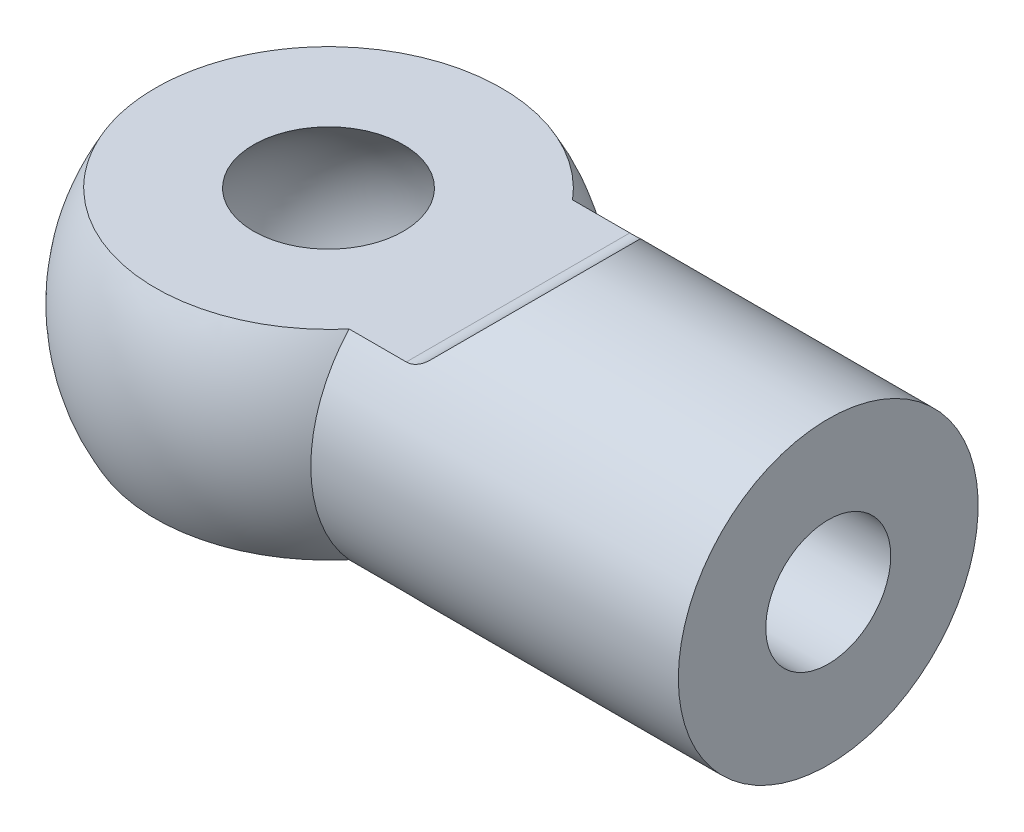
ISO-10303-21;
HEADER;
FILE_DESCRIPTION(('STEP AP214'),'2;1');
FILE_NAME('part.step','',(''),(''),'','','');
FILE_SCHEMA(('AUTOMOTIVE_DESIGN { 1 0 10303 214 1 1 1 1 }'));
ENDSEC;
DATA;
#1=APPLICATION_CONTEXT('core data for automotive mechanical design processes');
#2=APPLICATION_PROTOCOL_DEFINITION('international standard','automotive_design',2000,#1);
#3=PRODUCT_CONTEXT('',#1,'mechanical');
#4=PRODUCT('Part','Part','',(#3));
#5=PRODUCT_RELATED_PRODUCT_CATEGORY('part','',(#4));
#6=PRODUCT_DEFINITION_FORMATION('','',#4);
#7=PRODUCT_DEFINITION_CONTEXT('part definition',#1,'design');
#8=PRODUCT_DEFINITION('design','',#6,#7);
#9=PRODUCT_DEFINITION_SHAPE('','',#8);
#10=(LENGTH_UNIT() NAMED_UNIT(*) SI_UNIT(.MILLI.,.METRE.));
#11=(NAMED_UNIT(*) PLANE_ANGLE_UNIT() SI_UNIT($,.RADIAN.));
#12=(NAMED_UNIT(*) SI_UNIT($,.STERADIAN.) SOLID_ANGLE_UNIT());
#13=UNCERTAINTY_MEASURE_WITH_UNIT(LENGTH_MEASURE(1.E-05),#10,'distance_accuracy_value','');
#14=(GEOMETRIC_REPRESENTATION_CONTEXT(3) GLOBAL_UNCERTAINTY_ASSIGNED_CONTEXT((#13)) GLOBAL_UNIT_ASSIGNED_CONTEXT((#10,
#11,#12)) REPRESENTATION_CONTEXT('',''));
#15=CARTESIAN_POINT('',(0.,0.,0.));
#16=DIRECTION('',(0.,0.,1.));
#17=DIRECTION('',(1.,0.,0.));
#18=AXIS2_PLACEMENT_3D('',#15,#16,#17);
#19=CARTESIAN_POINT('',(0.,0.,0.));
#20=DIRECTION('',(-1.,0.,0.));
#21=DIRECTION('',(0.,0.,1.));
#22=AXIS2_PLACEMENT_3D('',#19,#20,#21);
#23=CYLINDRICAL_SURFACE('',#22,3.);
#24=CARTESIAN_POINT('',(10.,0.,0.));
#25=DIRECTION('',(-1.,0.,0.));
#26=DIRECTION('',(0.,0.,1.));
#27=AXIS2_PLACEMENT_3D('',#24,#25,#26);
#28=CIRCLE('',#27,3.);
#29=CARTESIAN_POINT('',(10.,0.,3.));
#30=VERTEX_POINT('',#29);
#31=EDGE_CURVE('E419',#30,#30,#28,.T.);
#32=ORIENTED_EDGE('',*,*,#31,.T.);
#33=EDGE_LOOP('',(#32));
#34=FACE_BOUND('',#33,.T.);
#35=DIRECTION('',(-1.,0.,0.));
#36=VECTOR('',#35,1.);
#37=CARTESIAN_POINT('',(0.,-2.,2.23606797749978));
#38=LINE('',#37,#36);
#39=CARTESIAN_POINT('',(2.6457513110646,-2.,2.23606797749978));
#40=VERTEX_POINT('',#39);
#41=CARTESIAN_POINT('',(3.79289321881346,-2.,2.23606797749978));
#42=VERTEX_POINT('',#41);
#43=EDGE_CURVE('E406',#40,#42,#38,.F.);
#44=ORIENTED_EDGE('',*,*,#43,.T.);
#45=CARTESIAN_POINT('',(3.79289321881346,-2.,2.23606797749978));
#46=CARTESIAN_POINT('',(3.81564348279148,-1.9999628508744,2.23609073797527));
#47=CARTESIAN_POINT('',(3.83835658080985,-2.00155029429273,2.23468148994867));
#48=CARTESIAN_POINT('',(3.88283202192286,-2.00765885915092,2.22920042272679));
#49=CARTESIAN_POINT('',(3.90460147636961,-2.01215122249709,2.22515470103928));
#50=CARTESIAN_POINT('',(3.94675574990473,-2.02375741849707,2.21460221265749));
#51=CARTESIAN_POINT('',(3.96714227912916,-2.03086794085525,2.20809855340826));
#52=CARTESIAN_POINT('',(4.00622199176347,-2.04729507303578,2.19287707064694));
#53=CARTESIAN_POINT('',(4.02490733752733,-2.05662124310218,2.1841496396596));
#54=CARTESIAN_POINT('',(4.06262231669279,-2.07835769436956,2.16348786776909));
#55=CARTESIAN_POINT('',(4.08135643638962,-2.09101453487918,2.15127938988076));
#56=CARTESIAN_POINT('',(4.11599095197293,-2.11778814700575,2.12493153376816));
#57=CARTESIAN_POINT('',(4.13190935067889,-2.13189465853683,2.11080552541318));
#58=CARTESIAN_POINT('',(4.14644660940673,-2.14644660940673,2.09589287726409));
#59=B_SPLINE_CURVE_WITH_KNOTS('',3,(#45,#46,#47,#48,#49,#50,#51,#52,#53,#54,#55,#56,#57,#58),
.UNSPECIFIED.,.F.,.F.,(4,2,2,2,2,2,4),(0.,0.0680932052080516,0.135522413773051,
0.202866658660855,0.270506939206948,0.347299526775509,0.423581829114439),.UNSPECIFIED.);
#60=CARTESIAN_POINT('',(4.14644660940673,-2.14644660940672,2.09589287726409));
#61=VERTEX_POINT('',#60);
#62=EDGE_CURVE('E11',#42,#61,#59,.T.);
#63=ORIENTED_EDGE('',*,*,#62,.T.);
#64=CARTESIAN_POINT('',(1.99999999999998,0.,0.));
#65=DIRECTION('',(0.707106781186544,0.707106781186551,0.));
#66=DIRECTION('',(-0.707106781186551,0.707106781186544,0.));
#67=AXIS2_PLACEMENT_3D('',#64,#65,#66);
#68=ELLIPSE('',#67,4.2426406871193,3.);
#69=CARTESIAN_POINT('',(4.14644660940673,-2.14644660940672,-2.09589287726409));
#70=VERTEX_POINT('',#69);
#71=EDGE_CURVE('E533',#61,#70,#68,.T.);
#72=ORIENTED_EDGE('',*,*,#71,.T.);
#73=CARTESIAN_POINT('',(4.14644660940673,-2.14644660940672,-2.09589287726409));
#74=CARTESIAN_POINT('',(4.13093845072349,-2.13091869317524,-2.11180744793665));
#75=CARTESIAN_POINT('',(4.1138494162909,-2.11589564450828,-2.12682631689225));
#76=CARTESIAN_POINT('',(4.07642523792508,-2.08749027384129,-2.15470922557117));
#77=CARTESIAN_POINT('',(4.05605806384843,-2.07412672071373,-2.16754912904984));
#78=CARTESIAN_POINT('',(4.01215742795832,-2.04993821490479,-2.19044220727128));
#79=CARTESIAN_POINT('',(3.98860137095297,-2.03913304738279,-2.20047376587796));
#80=CARTESIAN_POINT('',(3.93913757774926,-2.02114968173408,-2.21700335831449));
#81=CARTESIAN_POINT('',(3.91324645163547,-2.01394793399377,-2.22352435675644));
#82=CARTESIAN_POINT('',(3.87137788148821,-2.00595258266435,-2.23073297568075));
#83=CARTESIAN_POINT('',(3.85587806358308,-2.00373600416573,-2.23272226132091));
#84=CARTESIAN_POINT('',(3.82455572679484,-2.0007531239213,-2.23539443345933));
#85=CARTESIAN_POINT('',(3.80873204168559,-1.9999936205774,-2.23607119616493));
#86=CARTESIAN_POINT('',(3.79289321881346,-2.,-2.23606797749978));
#87=B_SPLINE_CURVE_WITH_KNOTS('',3,(#73,#74,#75,#76,#77,#78,#79,#80,#81,#82,#83,#84,#85,#86),
.UNSPECIFIED.,.F.,.F.,(4,2,2,2,2,2,4),(0.,0.0814016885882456,0.16365330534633,0.246521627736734,
0.32884106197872,0.376077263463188,0.423533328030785),.UNSPECIFIED.);
#88=CARTESIAN_POINT('',(3.79289321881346,-2.,-2.23606797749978));
#89=VERTEX_POINT('',#88);
#90=EDGE_CURVE('E359',#70,#89,#87,.T.);
#91=ORIENTED_EDGE('',*,*,#90,.T.);
#92=DIRECTION('',(-1.,0.,0.));
#93=VECTOR('',#92,1.);
#94=CARTESIAN_POINT('',(0.,-2.,-2.23606797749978));
#95=LINE('',#94,#93);
#96=CARTESIAN_POINT('',(2.6457513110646,-2.,-2.23606797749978));
#97=VERTEX_POINT('',#96);
#98=EDGE_CURVE('E400',#89,#97,#95,.T.);
#99=ORIENTED_EDGE('',*,*,#98,.T.);
#100=CARTESIAN_POINT('',(2.6457513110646,0.,0.));
#101=DIRECTION('',(-1.,0.,0.));
#102=DIRECTION('',(0.,0.,1.));
#103=AXIS2_PLACEMENT_3D('',#100,#101,#102);
#104=CIRCLE('',#103,3.);
#105=CARTESIAN_POINT('',(2.6457513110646,2.,-2.23606797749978));
#106=VERTEX_POINT('',#105);
#107=EDGE_CURVE('E404',#106,#97,#104,.T.);
#108=ORIENTED_EDGE('',*,*,#107,.F.);
#109=DIRECTION('',(-1.,0.,0.));
#110=VECTOR('',#109,1.);
#111=CARTESIAN_POINT('',(0.,2.,-2.23606797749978));
#112=LINE('',#111,#110);
#113=CARTESIAN_POINT('',(3.79289321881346,2.,-2.23606797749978));
#114=VERTEX_POINT('',#113);
#115=EDGE_CURVE('E425',#114,#106,#112,.T.);
#116=ORIENTED_EDGE('',*,*,#115,.F.);
#117=CARTESIAN_POINT('',(3.79289321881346,2.,-2.23606797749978));
#118=CARTESIAN_POINT('',(3.81564348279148,1.9999628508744,-2.23609073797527));
#119=CARTESIAN_POINT('',(3.83835658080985,2.00155029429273,-2.23468148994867));
#120=CARTESIAN_POINT('',(3.88283202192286,2.00765885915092,-2.22920042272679));
#121=CARTESIAN_POINT('',(3.90460147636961,2.01215122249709,-2.22515470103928));
#122=CARTESIAN_POINT('',(3.94675574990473,2.02375741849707,-2.21460221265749));
#123=CARTESIAN_POINT('',(3.96714227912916,2.03086794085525,-2.20809855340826));
#124=CARTESIAN_POINT('',(4.00622199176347,2.04729507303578,-2.19287707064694));
#125=CARTESIAN_POINT('',(4.02490733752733,2.05662124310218,-2.1841496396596));
#126=CARTESIAN_POINT('',(4.06262231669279,2.07835769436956,-2.16348786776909));
#127=CARTESIAN_POINT('',(4.08135643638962,2.09101453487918,-2.15127938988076));
#128=CARTESIAN_POINT('',(4.11599095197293,2.11778814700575,-2.12493153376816));
#129=CARTESIAN_POINT('',(4.13190935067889,2.13189465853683,-2.11080552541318));
#130=CARTESIAN_POINT('',(4.14644660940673,2.14644660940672,-2.09589287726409));
#131=B_SPLINE_CURVE_WITH_KNOTS('',3,(#117,#118,#119,#120,#121,#122,#123,#124,#125,#126,#127,
#128,#129,#130),.UNSPECIFIED.,.F.,.F.,(4,2,2,2,2,2,4),(0.,0.0680932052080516,0.135522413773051,
0.202866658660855,0.270506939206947,0.347299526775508,0.423581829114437),.UNSPECIFIED.);
#132=CARTESIAN_POINT('',(4.14644660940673,2.14644660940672,-2.09589287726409));
#133=VERTEX_POINT('',#132);
#134=EDGE_CURVE('E438',#114,#133,#131,.T.);
#135=ORIENTED_EDGE('',*,*,#134,.T.);
#136=CARTESIAN_POINT('',(1.99999999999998,0.,0.));
#137=DIRECTION('',(-0.707106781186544,0.707106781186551,0.));
#138=DIRECTION('',(-0.707106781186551,-0.707106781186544,0.));
#139=AXIS2_PLACEMENT_3D('',#136,#137,#138);
#140=ELLIPSE('',#139,4.2426406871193,3.);
#141=CARTESIAN_POINT('',(4.14644660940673,2.14644660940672,2.09589287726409));
#142=VERTEX_POINT('',#141);
#143=EDGE_CURVE('E423',#142,#133,#140,.T.);
#144=ORIENTED_EDGE('',*,*,#143,.F.);
#145=CARTESIAN_POINT('',(4.14644660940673,2.14644660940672,2.09589287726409));
#146=CARTESIAN_POINT('',(4.13093845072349,2.13091869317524,2.11180744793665));
#147=CARTESIAN_POINT('',(4.1138494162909,2.11589564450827,2.12682631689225));
#148=CARTESIAN_POINT('',(4.07642523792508,2.08749027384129,2.15470922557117));
#149=CARTESIAN_POINT('',(4.05605806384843,2.07412672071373,2.16754912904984));
#150=CARTESIAN_POINT('',(4.01215742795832,2.04993821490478,2.19044220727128));
#151=CARTESIAN_POINT('',(3.98860137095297,2.03913304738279,2.20047376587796));
#152=CARTESIAN_POINT('',(3.93913757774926,2.02114968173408,2.21700335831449));
#153=CARTESIAN_POINT('',(3.91324645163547,2.01394793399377,2.22352435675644));
#154=CARTESIAN_POINT('',(3.87137788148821,2.00595258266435,2.23073297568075));
#155=CARTESIAN_POINT('',(3.85587806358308,2.00373600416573,2.23272226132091));
#156=CARTESIAN_POINT('',(3.82455572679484,2.0007531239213,2.23539443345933));
#157=CARTESIAN_POINT('',(3.80873204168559,1.9999936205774,2.23607119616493));
#158=CARTESIAN_POINT('',(3.79289321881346,2.,2.23606797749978));
#159=B_SPLINE_CURVE_WITH_KNOTS('',3,(#145,#146,#147,#148,#149,#150,#151,#152,#153,#154,#155,
#156,#157,#158),.UNSPECIFIED.,.F.,.F.,(4,2,2,2,2,2,4),(0.,0.0814016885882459,0.16365330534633,
0.246521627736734,0.328841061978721,0.376077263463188,0.423533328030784),.UNSPECIFIED.);
#160=CARTESIAN_POINT('',(3.79289321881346,2.,2.23606797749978));
#161=VERTEX_POINT('',#160);
#162=EDGE_CURVE('E444',#142,#161,#159,.T.);
#163=ORIENTED_EDGE('',*,*,#162,.T.);
#164=DIRECTION('',(-1.,0.,0.));
#165=VECTOR('',#164,1.);
#166=CARTESIAN_POINT('',(0.,2.,2.23606797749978));
#167=LINE('',#166,#165);
#168=CARTESIAN_POINT('',(2.6457513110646,2.,2.23606797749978));
#169=VERTEX_POINT('',#168);
#170=EDGE_CURVE('E544',#169,#161,#167,.F.);
#171=ORIENTED_EDGE('',*,*,#170,.F.);
#172=EDGE_CURVE('E420',#40,#169,#104,.T.);
#173=ORIENTED_EDGE('',*,*,#172,.F.);
#174=EDGE_LOOP('',(#44,#63,#72,#91,#99,#108,#116,#135,#144,#163,#171,#173));
#175=FACE_BOUND('',#174,.T.);
#176=ADVANCED_FACE('F350',(#34,#175),#23,.T.);
#177=CARTESIAN_POINT('',(0.,0.,0.));
#178=DIRECTION('',(-1.,0.,0.));
#179=DIRECTION('',(0.,1.,0.));
#180=AXIS2_PLACEMENT_3D('',#177,#178,#179);
#181=SPHERICAL_SURFACE('',#180,4.);
#182=ORIENTED_EDGE('',*,*,#107,.T.);
#183=CARTESIAN_POINT('',(0.,-2.,0.));
#184=DIRECTION('',(0.,1.,0.));
#185=DIRECTION('',(0.,0.,1.));
#186=AXIS2_PLACEMENT_3D('',#183,#184,#185);
#187=CIRCLE('',#186,3.46410161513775);
#188=EDGE_CURVE('E409',#97,#40,#187,.T.);
#189=ORIENTED_EDGE('',*,*,#188,.T.);
#190=ORIENTED_EDGE('',*,*,#172,.T.);
#191=CARTESIAN_POINT('',(0.,2.,0.));
#192=DIRECTION('',(0.,1.,0.));
#193=DIRECTION('',(0.,0.,1.));
#194=AXIS2_PLACEMENT_3D('',#191,#192,#193);
#195=CIRCLE('',#194,3.46410161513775);
#196=EDGE_CURVE('E418',#106,#169,#195,.T.);
#197=ORIENTED_EDGE('',*,*,#196,.F.);
#198=EDGE_LOOP('',(#182,#189,#190,#197));
#199=FACE_BOUND('',#198,.T.);
#200=ADVANCED_FACE('F416',(#199),#181,.T.);
#201=CARTESIAN_POINT('',(10.,0.,0.));
#202=DIRECTION('',(-1.,0.,0.));
#203=DIRECTION('',(0.,0.,1.));
#204=AXIS2_PLACEMENT_3D('',#201,#202,#203);
#205=PLANE('',#204);
#206=CARTESIAN_POINT('',(10.,0.,0.));
#207=DIRECTION('',(1.,0.,0.));
#208=DIRECTION('',(0.,0.,-1.));
#209=AXIS2_PLACEMENT_3D('',#206,#207,#208);
#210=CIRCLE('',#209,1.25);
#211=CARTESIAN_POINT('',(10.,0.,-1.25));
#212=VERTEX_POINT('',#211);
#213=EDGE_CURVE('E538',#212,#212,#210,.T.);
#214=ORIENTED_EDGE('',*,*,#213,.F.);
#215=EDGE_LOOP('',(#214));
#216=FACE_BOUND('',#215,.T.);
#217=ORIENTED_EDGE('',*,*,#31,.F.);
#218=EDGE_LOOP('',(#217));
#219=FACE_BOUND('',#218,.T.);
#220=ADVANCED_FACE('F352',(#216,#219),#205,.F.);
#221=CARTESIAN_POINT('',(4.,2.,4.));
#222=DIRECTION('',(-0.707106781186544,0.707106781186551,0.));
#223=DIRECTION('',(-0.707106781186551,-0.707106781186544,0.));
#224=AXIS2_PLACEMENT_3D('',#221,#222,#223);
#225=PLANE('',#224);
#226=ORIENTED_EDGE('',*,*,#143,.T.);
#227=DIRECTION('',(0.,0.,-1.));
#228=VECTOR('',#227,1.);
#229=CARTESIAN_POINT('',(4.14644660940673,2.14644660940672,2.23606797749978));
#230=LINE('',#229,#228);
#231=EDGE_CURVE('E436',#133,#142,#230,.F.);
#232=ORIENTED_EDGE('',*,*,#231,.T.);
#233=EDGE_LOOP('',(#226,#232));
#234=FACE_BOUND('',#233,.T.);
#235=ADVANCED_FACE('F460',(#234),#225,.T.);
#236=CARTESIAN_POINT('',(-4.99999999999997,2.,4.));
#237=DIRECTION('',(0.,1.,0.));
#238=DIRECTION('',(0.,0.,1.));
#239=AXIS2_PLACEMENT_3D('',#236,#237,#238);
#240=PLANE('',#239);
#241=CARTESIAN_POINT('',(0.,2.,0.));
#242=DIRECTION('',(0.,1.,0.));
#243=DIRECTION('',(0.,0.,1.));
#244=AXIS2_PLACEMENT_3D('',#241,#242,#243);
#245=CIRCLE('',#244,1.5);
#246=CARTESIAN_POINT('',(0.,2.,1.5));
#247=VERTEX_POINT('',#246);
#248=EDGE_CURVE('E405',#247,#247,#245,.F.);
#249=ORIENTED_EDGE('',*,*,#248,.T.);
#250=EDGE_LOOP('',(#249));
#251=FACE_BOUND('',#250,.T.);
#252=ORIENTED_EDGE('',*,*,#170,.T.);
#253=DIRECTION('',(0.,0.,-1.));
#254=VECTOR('',#253,1.);
#255=CARTESIAN_POINT('',(3.79289321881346,2.,-2.23606797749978));
#256=LINE('',#255,#254);
#257=EDGE_CURVE('E433',#161,#114,#256,.T.);
#258=ORIENTED_EDGE('',*,*,#257,.T.);
#259=ORIENTED_EDGE('',*,*,#115,.T.);
#260=ORIENTED_EDGE('',*,*,#196,.T.);
#261=EDGE_LOOP('',(#252,#258,#259,#260));
#262=FACE_BOUND('',#261,.T.);
#263=ADVANCED_FACE('F464',(#251,#262),#240,.T.);
#264=CARTESIAN_POINT('',(0.,0.,0.));
#265=DIRECTION('',(-1.,0.,0.));
#266=DIRECTION('',(0.,-1.,0.));
#267=AXIS2_PLACEMENT_3D('',#264,#265,#266);
#268=SPHERICAL_SURFACE('',#267,2.5);
#269=CARTESIAN_POINT('',(2.1650635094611,0.,0.));
#270=DIRECTION('',(-1.,0.,0.));
#271=DIRECTION('',(0.,0.,1.));
#272=AXIS2_PLACEMENT_3D('',#269,#270,#271);
#273=CIRCLE('',#272,1.25);
#274=CARTESIAN_POINT('',(2.1650635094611,0.,1.25));
#275=VERTEX_POINT('',#274);
#276=EDGE_CURVE('E354',#275,#275,#273,.F.);
#277=ORIENTED_EDGE('',*,*,#276,.T.);
#278=EDGE_LOOP('',(#277));
#279=FACE_BOUND('',#278,.T.);
#280=CARTESIAN_POINT('',(0.,-2.,0.));
#281=DIRECTION('',(0.,1.,0.));
#282=DIRECTION('',(0.,0.,1.));
#283=AXIS2_PLACEMENT_3D('',#280,#281,#282);
#284=CIRCLE('',#283,1.5);
#285=CARTESIAN_POINT('',(0.,-2.,1.5));
#286=VERTEX_POINT('',#285);
#287=EDGE_CURVE('E413',#286,#286,#284,.F.);
#288=ORIENTED_EDGE('',*,*,#287,.T.);
#289=EDGE_LOOP('',(#288));
#290=FACE_BOUND('',#289,.T.);
#291=ORIENTED_EDGE('',*,*,#248,.F.);
#292=EDGE_LOOP('',(#291));
#293=FACE_BOUND('',#292,.T.);
#294=ADVANCED_FACE('F457',(#279,#290,#293),#268,.F.);
#295=CARTESIAN_POINT('',(3.79289321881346,2.5,4.));
#296=DIRECTION('',(0.,0.,1.));
#297=DIRECTION('',(1.,0.,0.));
#298=AXIS2_PLACEMENT_3D('',#295,#296,#297);
#299=CYLINDRICAL_SURFACE('',#298,0.5);
#300=ORIENTED_EDGE('',*,*,#162,.F.);
#301=ORIENTED_EDGE('',*,*,#231,.F.);
#302=ORIENTED_EDGE('',*,*,#134,.F.);
#303=ORIENTED_EDGE('',*,*,#257,.F.);
#304=EDGE_LOOP('',(#300,#301,#302,#303));
#305=FACE_BOUND('',#304,.T.);
#306=ADVANCED_FACE('F451',(#305),#299,.F.);
#307=CARTESIAN_POINT('',(4.,-2.,4.));
#308=DIRECTION('',(0.707106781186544,0.707106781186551,0.));
#309=DIRECTION('',(-0.707106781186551,0.707106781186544,0.));
#310=AXIS2_PLACEMENT_3D('',#307,#308,#309);
#311=PLANE('',#310);
#312=ORIENTED_EDGE('',*,*,#71,.F.);
#313=DIRECTION('',(0.,0.,-1.));
#314=VECTOR('',#313,1.);
#315=CARTESIAN_POINT('',(4.14644660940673,-2.14644660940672,-2.23606797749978));
#316=LINE('',#315,#314);
#317=EDGE_CURVE('E530',#61,#70,#316,.T.);
#318=ORIENTED_EDGE('',*,*,#317,.T.);
#319=EDGE_LOOP('',(#312,#318));
#320=FACE_BOUND('',#319,.T.);
#321=ADVANCED_FACE('F456',(#320),#311,.F.);
#322=CARTESIAN_POINT('',(-4.99999999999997,-2.,4.));
#323=DIRECTION('',(0.,1.,0.));
#324=DIRECTION('',(0.,0.,1.));
#325=AXIS2_PLACEMENT_3D('',#322,#323,#324);
#326=PLANE('',#325);
#327=ORIENTED_EDGE('',*,*,#287,.F.);
#328=EDGE_LOOP('',(#327));
#329=FACE_BOUND('',#328,.T.);
#330=ORIENTED_EDGE('',*,*,#98,.F.);
#331=DIRECTION('',(0.,0.,-1.));
#332=VECTOR('',#331,1.);
#333=CARTESIAN_POINT('',(3.79289321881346,-2.,2.23606797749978));
#334=LINE('',#333,#332);
#335=EDGE_CURVE('E372',#89,#42,#334,.F.);
#336=ORIENTED_EDGE('',*,*,#335,.T.);
#337=ORIENTED_EDGE('',*,*,#43,.F.);
#338=ORIENTED_EDGE('',*,*,#188,.F.);
#339=EDGE_LOOP('',(#330,#336,#337,#338));
#340=FACE_BOUND('',#339,.T.);
#341=ADVANCED_FACE('F410',(#329,#340),#326,.F.);
#342=CARTESIAN_POINT('',(3.79289321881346,-2.5,4.));
#343=DIRECTION('',(0.,0.,1.));
#344=DIRECTION('',(1.,0.,0.));
#345=AXIS2_PLACEMENT_3D('',#342,#343,#344);
#346=CYLINDRICAL_SURFACE('',#345,0.5);
#347=ORIENTED_EDGE('',*,*,#62,.F.);
#348=ORIENTED_EDGE('',*,*,#335,.F.);
#349=ORIENTED_EDGE('',*,*,#90,.F.);
#350=ORIENTED_EDGE('',*,*,#317,.F.);
#351=EDGE_LOOP('',(#347,#348,#349,#350));
#352=FACE_BOUND('',#351,.T.);
#353=ADVANCED_FACE('F498',(#352),#346,.F.);
#354=CARTESIAN_POINT('',(10.,0.,0.));
#355=DIRECTION('',(1.,0.,0.));
#356=DIRECTION('',(0.,0.,-1.));
#357=AXIS2_PLACEMENT_3D('',#354,#355,#356);
#358=CYLINDRICAL_SURFACE('',#357,1.25);
#359=ORIENTED_EDGE('',*,*,#213,.T.);
#360=EDGE_LOOP('',(#359));
#361=FACE_BOUND('',#360,.T.);
#362=ORIENTED_EDGE('',*,*,#276,.F.);
#363=EDGE_LOOP('',(#362));
#364=FACE_BOUND('',#363,.T.);
#365=ADVANCED_FACE('F505',(#361,#364),#358,.F.);
#366=CLOSED_SHELL('',(#176,#200,#220,#235,#263,#294,#306,#321,#341,#353,#365));
#367=MANIFOLD_SOLID_BREP('B2',#366);
#368=ADVANCED_BREP_SHAPE_REPRESENTATION('',(#18,#367),#14);
#369=SHAPE_DEFINITION_REPRESENTATION(#9,#368);
ENDSEC;
END-ISO-10303-21;
